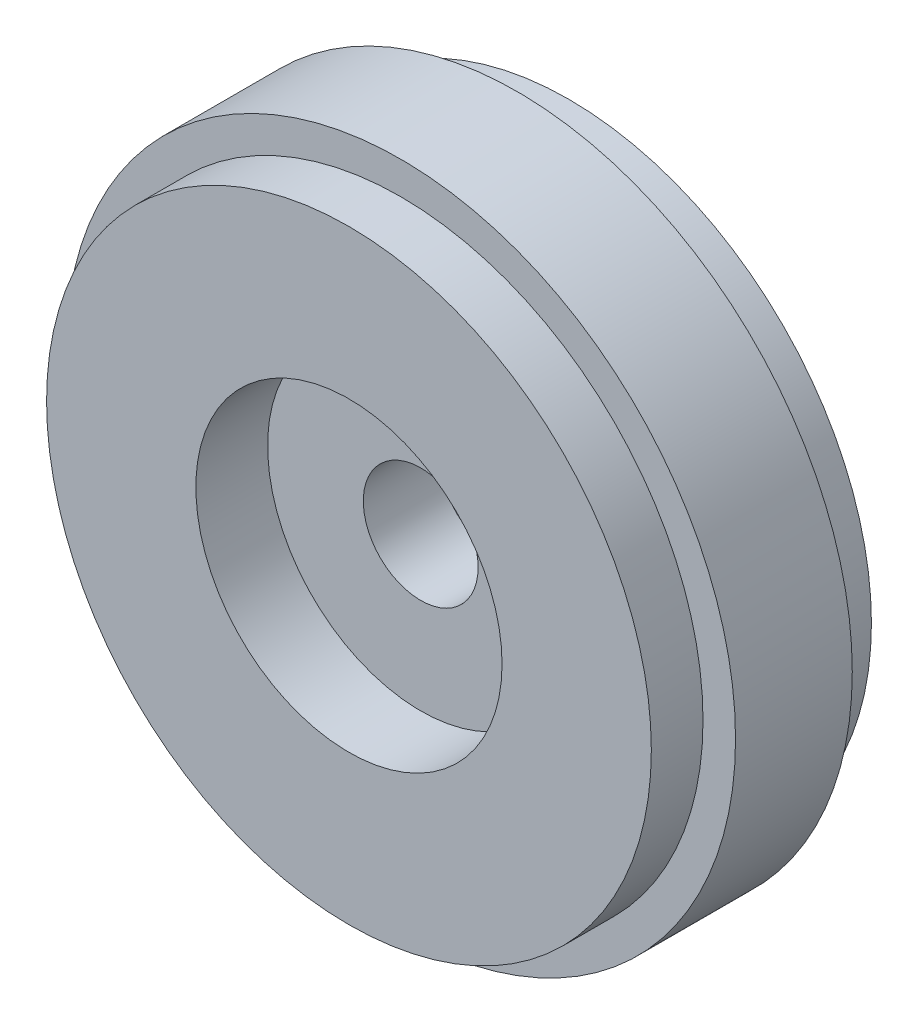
ISO-10303-21;
HEADER;
FILE_DESCRIPTION(('STEP AP214'),'2;1');
FILE_NAME('part.step','',(''),(''),'','','');
FILE_SCHEMA(('AUTOMOTIVE_DESIGN { 1 0 10303 214 1 1 1 1 }'));
ENDSEC;
DATA;
#1=APPLICATION_CONTEXT('core data for automotive mechanical design processes');
#2=APPLICATION_PROTOCOL_DEFINITION('international standard','automotive_design',2000,#1);
#3=PRODUCT_CONTEXT('',#1,'mechanical');
#4=PRODUCT('Part','Part','',(#3));
#5=PRODUCT_RELATED_PRODUCT_CATEGORY('part','',(#4));
#6=PRODUCT_DEFINITION_FORMATION('','',#4);
#7=PRODUCT_DEFINITION_CONTEXT('part definition',#1,'design');
#8=PRODUCT_DEFINITION('design','',#6,#7);
#9=PRODUCT_DEFINITION_SHAPE('','',#8);
#10=(LENGTH_UNIT() NAMED_UNIT(*) SI_UNIT(.MILLI.,.METRE.));
#11=(NAMED_UNIT(*) PLANE_ANGLE_UNIT() SI_UNIT($,.RADIAN.));
#12=(NAMED_UNIT(*) SI_UNIT($,.STERADIAN.) SOLID_ANGLE_UNIT());
#13=UNCERTAINTY_MEASURE_WITH_UNIT(LENGTH_MEASURE(1.E-05),#10,'distance_accuracy_value','');
#14=(GEOMETRIC_REPRESENTATION_CONTEXT(3) GLOBAL_UNCERTAINTY_ASSIGNED_CONTEXT((#13)) GLOBAL_UNIT_ASSIGNED_CONTEXT((#10,
#11,#12)) REPRESENTATION_CONTEXT('',''));
#15=CARTESIAN_POINT('',(0.,0.,0.));
#16=DIRECTION('',(0.,0.,1.));
#17=DIRECTION('',(1.,0.,0.));
#18=AXIS2_PLACEMENT_3D('',#15,#16,#17);
#19=CARTESIAN_POINT('',(0.,13.,-11.5));
#20=DIRECTION('',(0.,0.,1.));
#21=DIRECTION('',(1.,0.,0.));
#22=AXIS2_PLACEMENT_3D('',#19,#20,#21);
#23=PLANE('',#22);
#24=CARTESIAN_POINT('',(0.,0.,-11.5));
#25=DIRECTION('',(0.,0.,1.));
#26=DIRECTION('',(1.,0.,0.));
#27=AXIS2_PLACEMENT_3D('',#24,#25,#26);
#28=CIRCLE('',#27,13.);
#29=CARTESIAN_POINT('',(13.,0.,-11.5));
#30=VERTEX_POINT('',#29);
#31=EDGE_CURVE('E8',#30,#30,#28,.T.);
#32=ORIENTED_EDGE('',*,*,#31,.T.);
#33=EDGE_LOOP('',(#32));
#34=FACE_BOUND('',#33,.T.);
#35=CARTESIAN_POINT('',(0.,0.,-11.5));
#36=DIRECTION('',(0.,0.,1.));
#37=DIRECTION('',(1.,0.,0.));
#38=AXIS2_PLACEMENT_3D('',#35,#36,#37);
#39=CIRCLE('',#38,31.6);
#40=CARTESIAN_POINT('',(31.6,0.,-11.5));
#41=VERTEX_POINT('',#40);
#42=EDGE_CURVE('E15',#41,#41,#39,.T.);
#43=ORIENTED_EDGE('',*,*,#42,.F.);
#44=EDGE_LOOP('',(#43));
#45=FACE_BOUND('',#44,.T.);
#46=ADVANCED_FACE('F12',(#34,#45),#23,.F.);
#47=CARTESIAN_POINT('',(0.,35.,11.5));
#48=DIRECTION('',(0.,0.,-1.));
#49=DIRECTION('',(-1.,0.,0.));
#50=AXIS2_PLACEMENT_3D('',#47,#48,#49);
#51=PLANE('',#50);
#52=CARTESIAN_POINT('',(0.,0.,11.5));
#53=DIRECTION('',(0.,0.,1.));
#54=DIRECTION('',(1.,0.,0.));
#55=AXIS2_PLACEMENT_3D('',#52,#53,#54);
#56=CIRCLE('',#55,16.);
#57=CARTESIAN_POINT('',(16.,0.,11.5));
#58=VERTEX_POINT('',#57);
#59=EDGE_CURVE('E33',#58,#58,#56,.T.);
#60=ORIENTED_EDGE('',*,*,#59,.F.);
#61=EDGE_LOOP('',(#60));
#62=FACE_BOUND('',#61,.T.);
#63=CARTESIAN_POINT('',(0.,0.,11.5));
#64=DIRECTION('',(0.,0.,-1.));
#65=DIRECTION('',(-1.,0.,0.));
#66=AXIS2_PLACEMENT_3D('',#63,#64,#65);
#67=CIRCLE('',#66,31.6);
#68=CARTESIAN_POINT('',(-31.6,0.,11.5));
#69=VERTEX_POINT('',#68);
#70=EDGE_CURVE('E27',#69,#69,#67,.T.);
#71=ORIENTED_EDGE('',*,*,#70,.F.);
#72=EDGE_LOOP('',(#71));
#73=FACE_BOUND('',#72,.T.);
#74=ADVANCED_FACE('F75',(#62,#73),#51,.F.);
#75=CARTESIAN_POINT('',(0.,0.,2.9819902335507));
#76=DIRECTION('',(0.,0.,1.));
#77=DIRECTION('',(1.,0.,0.));
#78=AXIS2_PLACEMENT_3D('',#75,#76,#77);
#79=CYLINDRICAL_SURFACE('',#78,13.);
#80=ORIENTED_EDGE('',*,*,#31,.F.);
#81=EDGE_LOOP('',(#80));
#82=FACE_BOUND('',#81,.T.);
#83=CARTESIAN_POINT('',(0.,0.,-4.));
#84=DIRECTION('',(0.,0.,1.));
#85=DIRECTION('',(1.,0.,0.));
#86=AXIS2_PLACEMENT_3D('',#83,#84,#85);
#87=CIRCLE('',#86,13.);
#88=CARTESIAN_POINT('',(13.,0.,-4.));
#89=VERTEX_POINT('',#88);
#90=EDGE_CURVE('E19',#89,#89,#87,.T.);
#91=ORIENTED_EDGE('',*,*,#90,.T.);
#92=EDGE_LOOP('',(#91));
#93=FACE_BOUND('',#92,.T.);
#94=ADVANCED_FACE('F78',(#82,#93),#79,.F.);
#95=CARTESIAN_POINT('',(0.,6.,-4.));
#96=DIRECTION('',(0.,0.,1.));
#97=DIRECTION('',(1.,0.,0.));
#98=AXIS2_PLACEMENT_3D('',#95,#96,#97);
#99=PLANE('',#98);
#100=ORIENTED_EDGE('',*,*,#90,.F.);
#101=EDGE_LOOP('',(#100));
#102=FACE_BOUND('',#101,.T.);
#103=CARTESIAN_POINT('',(0.,0.,-4.));
#104=DIRECTION('',(0.,0.,1.));
#105=DIRECTION('',(1.,0.,0.));
#106=AXIS2_PLACEMENT_3D('',#103,#104,#105);
#107=CIRCLE('',#106,6.);
#108=CARTESIAN_POINT('',(6.,0.,-4.));
#109=VERTEX_POINT('',#108);
#110=EDGE_CURVE('E24',#109,#109,#107,.T.);
#111=ORIENTED_EDGE('',*,*,#110,.T.);
#112=EDGE_LOOP('',(#111));
#113=FACE_BOUND('',#112,.T.);
#114=ADVANCED_FACE('F54',(#102,#113),#99,.F.);
#115=CARTESIAN_POINT('',(0.,0.,2.9819902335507));
#116=DIRECTION('',(0.,0.,1.));
#117=DIRECTION('',(1.,0.,0.));
#118=AXIS2_PLACEMENT_3D('',#115,#116,#117);
#119=CYLINDRICAL_SURFACE('',#118,6.);
#120=ORIENTED_EDGE('',*,*,#110,.F.);
#121=EDGE_LOOP('',(#120));
#122=FACE_BOUND('',#121,.T.);
#123=CARTESIAN_POINT('',(0.,0.,4.));
#124=DIRECTION('',(0.,0.,1.));
#125=DIRECTION('',(1.,0.,0.));
#126=AXIS2_PLACEMENT_3D('',#123,#124,#125);
#127=CIRCLE('',#126,6.);
#128=CARTESIAN_POINT('',(6.,0.,4.));
#129=VERTEX_POINT('',#128);
#130=EDGE_CURVE('E49',#129,#129,#127,.T.);
#131=ORIENTED_EDGE('',*,*,#130,.T.);
#132=EDGE_LOOP('',(#131));
#133=FACE_BOUND('',#132,.T.);
#134=ADVANCED_FACE('F56',(#122,#133),#119,.F.);
#135=CARTESIAN_POINT('',(0.,16.,4.));
#136=DIRECTION('',(0.,0.,-1.));
#137=DIRECTION('',(-1.,0.,0.));
#138=AXIS2_PLACEMENT_3D('',#135,#136,#137);
#139=PLANE('',#138);
#140=ORIENTED_EDGE('',*,*,#130,.F.);
#141=EDGE_LOOP('',(#140));
#142=FACE_BOUND('',#141,.T.);
#143=CARTESIAN_POINT('',(0.,0.,4.));
#144=DIRECTION('',(0.,0.,1.));
#145=DIRECTION('',(1.,0.,0.));
#146=AXIS2_PLACEMENT_3D('',#143,#144,#145);
#147=CIRCLE('',#146,16.);
#148=CARTESIAN_POINT('',(16.,0.,4.));
#149=VERTEX_POINT('',#148);
#150=EDGE_CURVE('E46',#149,#149,#147,.T.);
#151=ORIENTED_EDGE('',*,*,#150,.T.);
#152=EDGE_LOOP('',(#151));
#153=FACE_BOUND('',#152,.T.);
#154=ADVANCED_FACE('F59',(#142,#153),#139,.F.);
#155=CARTESIAN_POINT('',(0.,0.,2.9819902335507));
#156=DIRECTION('',(0.,0.,1.));
#157=DIRECTION('',(1.,0.,0.));
#158=AXIS2_PLACEMENT_3D('',#155,#156,#157);
#159=CYLINDRICAL_SURFACE('',#158,16.);
#160=ORIENTED_EDGE('',*,*,#150,.F.);
#161=EDGE_LOOP('',(#160));
#162=FACE_BOUND('',#161,.T.);
#163=ORIENTED_EDGE('',*,*,#59,.T.);
#164=EDGE_LOOP('',(#163));
#165=FACE_BOUND('',#164,.T.);
#166=ADVANCED_FACE('F65',(#162,#165),#159,.F.);
#167=CARTESIAN_POINT('',(0.,0.,24.4851675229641));
#168=DIRECTION('',(0.,0.,1.));
#169=DIRECTION('',(1.,0.,0.));
#170=AXIS2_PLACEMENT_3D('',#167,#168,#169);
#171=CYLINDRICAL_SURFACE('',#170,31.6);
#172=CARTESIAN_POINT('',(0.,0.,-6.1));
#173=DIRECTION('',(0.,0.,1.));
#174=DIRECTION('',(1.,0.,0.));
#175=AXIS2_PLACEMENT_3D('',#172,#173,#174);
#176=CIRCLE('',#175,31.6);
#177=CARTESIAN_POINT('',(31.6,0.,-6.1));
#178=VERTEX_POINT('',#177);
#179=EDGE_CURVE('E35',#178,#178,#176,.T.);
#180=ORIENTED_EDGE('',*,*,#179,.F.);
#181=EDGE_LOOP('',(#180));
#182=FACE_BOUND('',#181,.T.);
#183=ORIENTED_EDGE('',*,*,#42,.T.);
#184=EDGE_LOOP('',(#183));
#185=FACE_BOUND('',#184,.T.);
#186=ADVANCED_FACE('F71',(#182,#185),#171,.T.);
#187=CARTESIAN_POINT('',(0.,0.,24.4851675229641));
#188=DIRECTION('',(0.,0.,1.));
#189=DIRECTION('',(1.,0.,0.));
#190=AXIS2_PLACEMENT_3D('',#187,#188,#189);
#191=CYLINDRICAL_SURFACE('',#190,31.6);
#192=CARTESIAN_POINT('',(0.,0.,6.1));
#193=DIRECTION('',(0.,0.,1.));
#194=DIRECTION('',(1.,0.,0.));
#195=AXIS2_PLACEMENT_3D('',#192,#193,#194);
#196=CIRCLE('',#195,31.6);
#197=CARTESIAN_POINT('',(31.6,0.,6.1));
#198=VERTEX_POINT('',#197);
#199=EDGE_CURVE('E40',#198,#198,#196,.T.);
#200=ORIENTED_EDGE('',*,*,#199,.T.);
#201=EDGE_LOOP('',(#200));
#202=FACE_BOUND('',#201,.T.);
#203=ORIENTED_EDGE('',*,*,#70,.T.);
#204=EDGE_LOOP('',(#203));
#205=FACE_BOUND('',#204,.T.);
#206=ADVANCED_FACE('F127',(#202,#205),#191,.T.);
#207=CARTESIAN_POINT('',(0.,0.,24.4851675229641));
#208=DIRECTION('',(0.,0.,1.));
#209=DIRECTION('',(1.,0.,0.));
#210=AXIS2_PLACEMENT_3D('',#207,#208,#209);
#211=CYLINDRICAL_SURFACE('',#210,35.);
#212=CARTESIAN_POINT('',(0.,0.,-6.1));
#213=DIRECTION('',(0.,0.,1.));
#214=DIRECTION('',(1.,0.,0.));
#215=AXIS2_PLACEMENT_3D('',#212,#213,#214);
#216=CIRCLE('',#215,35.);
#217=CARTESIAN_POINT('',(35.,0.,-6.1));
#218=VERTEX_POINT('',#217);
#219=EDGE_CURVE('E29',#218,#218,#216,.T.);
#220=ORIENTED_EDGE('',*,*,#219,.T.);
#221=EDGE_LOOP('',(#220));
#222=FACE_BOUND('',#221,.T.);
#223=CARTESIAN_POINT('',(0.,0.,6.1));
#224=DIRECTION('',(0.,0.,1.));
#225=DIRECTION('',(1.,0.,0.));
#226=AXIS2_PLACEMENT_3D('',#223,#224,#225);
#227=CIRCLE('',#226,35.);
#228=CARTESIAN_POINT('',(35.,0.,6.1));
#229=VERTEX_POINT('',#228);
#230=EDGE_CURVE('E189',#229,#229,#227,.T.);
#231=ORIENTED_EDGE('',*,*,#230,.F.);
#232=EDGE_LOOP('',(#231));
#233=FACE_BOUND('',#232,.T.);
#234=ADVANCED_FACE('F88',(#222,#233),#211,.T.);
#235=CARTESIAN_POINT('',(0.,31.6,-6.1));
#236=DIRECTION('',(0.,0.,-1.));
#237=DIRECTION('',(-1.,0.,0.));
#238=AXIS2_PLACEMENT_3D('',#235,#236,#237);
#239=PLANE('',#238);
#240=ORIENTED_EDGE('',*,*,#179,.T.);
#241=EDGE_LOOP('',(#240));
#242=FACE_BOUND('',#241,.T.);
#243=ORIENTED_EDGE('',*,*,#219,.F.);
#244=EDGE_LOOP('',(#243));
#245=FACE_BOUND('',#244,.T.);
#246=ADVANCED_FACE('F144',(#242,#245),#239,.T.);
#247=CARTESIAN_POINT('',(0.,35.,6.1));
#248=DIRECTION('',(0.,0.,1.));
#249=DIRECTION('',(1.,0.,0.));
#250=AXIS2_PLACEMENT_3D('',#247,#248,#249);
#251=PLANE('',#250);
#252=ORIENTED_EDGE('',*,*,#230,.T.);
#253=EDGE_LOOP('',(#252));
#254=FACE_BOUND('',#253,.T.);
#255=ORIENTED_EDGE('',*,*,#199,.F.);
#256=EDGE_LOOP('',(#255));
#257=FACE_BOUND('',#256,.T.);
#258=ADVANCED_FACE('F151',(#254,#257),#251,.T.);
#259=CLOSED_SHELL('',(#46,#74,#94,#114,#134,#154,#166,#186,#206,#234,#246,#258));
#260=MANIFOLD_SOLID_BREP('B1',#259);
#261=ADVANCED_BREP_SHAPE_REPRESENTATION('',(#18,#260),#14);
#262=SHAPE_DEFINITION_REPRESENTATION(#9,#261);
ENDSEC;
END-ISO-10303-21;
